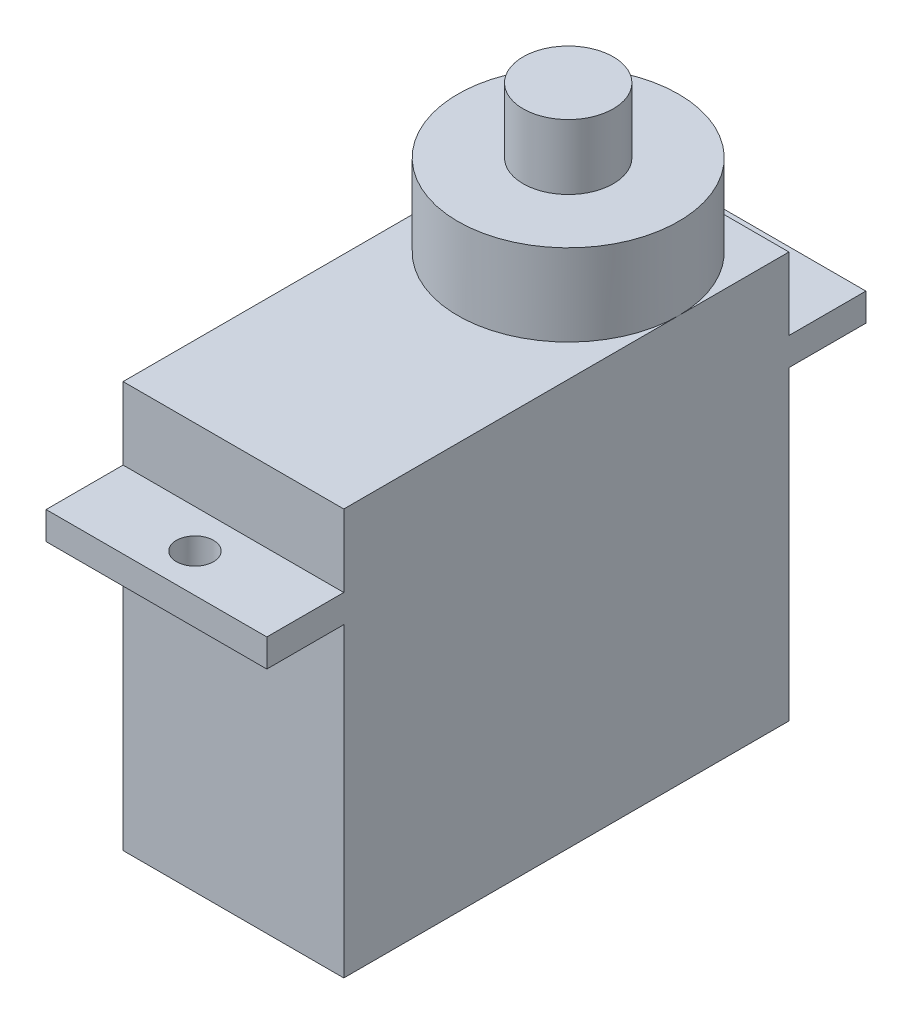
ISO-10303-21;
HEADER;
FILE_DESCRIPTION(('STEP AP214'),'2;1');
FILE_NAME('part.step','',(''),(''),'','','');
FILE_SCHEMA(('AUTOMOTIVE_DESIGN { 1 0 10303 214 1 1 1 1 }'));
ENDSEC;
DATA;
#1=APPLICATION_CONTEXT('core data for automotive mechanical design processes');
#2=APPLICATION_PROTOCOL_DEFINITION('international standard','automotive_design',2000,#1);
#3=PRODUCT_CONTEXT('',#1,'mechanical');
#4=PRODUCT('Part','Part','',(#3));
#5=PRODUCT_RELATED_PRODUCT_CATEGORY('part','',(#4));
#6=PRODUCT_DEFINITION_FORMATION('','',#4);
#7=PRODUCT_DEFINITION_CONTEXT('part definition',#1,'design');
#8=PRODUCT_DEFINITION('design','',#6,#7);
#9=PRODUCT_DEFINITION_SHAPE('','',#8);
#10=(LENGTH_UNIT() NAMED_UNIT(*) SI_UNIT(.MILLI.,.METRE.));
#11=(NAMED_UNIT(*) PLANE_ANGLE_UNIT() SI_UNIT($,.RADIAN.));
#12=(NAMED_UNIT(*) SI_UNIT($,.STERADIAN.) SOLID_ANGLE_UNIT());
#13=UNCERTAINTY_MEASURE_WITH_UNIT(LENGTH_MEASURE(1.E-05),#10,'distance_accuracy_value','');
#14=(GEOMETRIC_REPRESENTATION_CONTEXT(3) GLOBAL_UNCERTAINTY_ASSIGNED_CONTEXT((#13)) GLOBAL_UNIT_ASSIGNED_CONTEXT((#10,
#11,#12)) REPRESENTATION_CONTEXT('',''));
#15=CARTESIAN_POINT('',(0.,0.,0.));
#16=DIRECTION('',(0.,0.,1.));
#17=DIRECTION('',(1.,0.,0.));
#18=AXIS2_PLACEMENT_3D('',#15,#16,#17);
#19=CARTESIAN_POINT('',(-5.95,16.5,-12.));
#20=DIRECTION('',(0.,0.,1.));
#21=DIRECTION('',(1.,0.,0.));
#22=AXIS2_PLACEMENT_3D('',#19,#20,#21);
#23=PLANE('',#22);
#24=DIRECTION('',(0.,1.,0.));
#25=VECTOR('',#24,1.);
#26=CARTESIAN_POINT('',(-2.,3.,-12.));
#27=LINE('',#26,#25);
#28=CARTESIAN_POINT('',(-2.,0.,-12.));
#29=VERTEX_POINT('',#28);
#30=CARTESIAN_POINT('',(-2.,3.,-12.));
#31=VERTEX_POINT('',#30);
#32=EDGE_CURVE('E177',#29,#31,#27,.T.);
#33=ORIENTED_EDGE('',*,*,#32,.F.);
#34=DIRECTION('',(-1.,0.,0.));
#35=VECTOR('',#34,1.);
#36=CARTESIAN_POINT('',(-5.95,0.,-12.));
#37=LINE('',#36,#35);
#38=CARTESIAN_POINT('',(-5.95,0.,-12.));
#39=VERTEX_POINT('',#38);
#40=EDGE_CURVE('E341',#29,#39,#37,.T.);
#41=ORIENTED_EDGE('',*,*,#40,.T.);
#42=DIRECTION('',(0.,-1.,0.));
#43=VECTOR('',#42,1.);
#44=CARTESIAN_POINT('',(-5.95,16.5,-12.));
#45=LINE('',#44,#43);
#46=CARTESIAN_POINT('',(-5.95,16.5,-12.));
#47=VERTEX_POINT('',#46);
#48=EDGE_CURVE('E362',#47,#39,#45,.T.);
#49=ORIENTED_EDGE('',*,*,#48,.F.);
#50=DIRECTION('',(-1.,0.,0.));
#51=VECTOR('',#50,1.);
#52=CARTESIAN_POINT('',(-5.95,16.5,-12.));
#53=LINE('',#52,#51);
#54=CARTESIAN_POINT('',(5.95,16.5,-12.));
#55=VERTEX_POINT('',#54);
#56=EDGE_CURVE('E335',#55,#47,#53,.T.);
#57=ORIENTED_EDGE('',*,*,#56,.F.);
#58=DIRECTION('',(0.,-1.,0.));
#59=VECTOR('',#58,1.);
#60=CARTESIAN_POINT('',(5.95,16.5,-12.));
#61=LINE('',#60,#59);
#62=CARTESIAN_POINT('',(5.95,0.,-12.));
#63=VERTEX_POINT('',#62);
#64=EDGE_CURVE('E364',#55,#63,#61,.T.);
#65=ORIENTED_EDGE('',*,*,#64,.T.);
#66=CARTESIAN_POINT('',(2.,0.,-12.));
#67=VERTEX_POINT('',#66);
#68=EDGE_CURVE('E347',#63,#67,#37,.T.);
#69=ORIENTED_EDGE('',*,*,#68,.T.);
#70=DIRECTION('',(0.,-1.,0.));
#71=VECTOR('',#70,1.);
#72=CARTESIAN_POINT('',(2.,3.,-12.));
#73=LINE('',#72,#71);
#74=CARTESIAN_POINT('',(2.,3.,-12.));
#75=VERTEX_POINT('',#74);
#76=EDGE_CURVE('E195',#75,#67,#73,.T.);
#77=ORIENTED_EDGE('',*,*,#76,.F.);
#78=DIRECTION('',(1.,0.,0.));
#79=VECTOR('',#78,1.);
#80=CARTESIAN_POINT('',(2.,3.,-12.));
#81=LINE('',#80,#79);
#82=EDGE_CURVE('E197',#31,#75,#81,.T.);
#83=ORIENTED_EDGE('',*,*,#82,.F.);
#84=EDGE_LOOP('',(#33,#41,#49,#57,#65,#69,#77,#83));
#85=FACE_BOUND('',#84,.T.);
#86=ADVANCED_FACE('F44',(#85),#23,.F.);
#87=CARTESIAN_POINT('',(0.,21.9,0.));
#88=DIRECTION('',(0.,1.,0.));
#89=DIRECTION('',(0.,0.,1.));
#90=AXIS2_PLACEMENT_3D('',#87,#88,#89);
#91=PLANE('',#90);
#92=CARTESIAN_POINT('',(0.,21.9,-6.05));
#93=DIRECTION('',(0.,1.,0.));
#94=DIRECTION('',(0.,0.,1.));
#95=AXIS2_PLACEMENT_3D('',#92,#93,#94);
#96=CIRCLE('',#95,5.95);
#97=CARTESIAN_POINT('',(5.95,21.9,-6.05));
#98=VERTEX_POINT('',#97);
#99=CARTESIAN_POINT('',(0.,21.9,-12.));
#100=VERTEX_POINT('',#99);
#101=EDGE_CURVE('E234',#98,#100,#96,.T.);
#102=ORIENTED_EDGE('',*,*,#101,.F.);
#103=DIRECTION('',(0.,0.,1.));
#104=VECTOR('',#103,1.);
#105=CARTESIAN_POINT('',(5.95,21.9,-12.));
#106=LINE('',#105,#104);
#107=CARTESIAN_POINT('',(5.95,21.9,-12.));
#108=VERTEX_POINT('',#107);
#109=EDGE_CURVE('E252',#108,#98,#106,.T.);
#110=ORIENTED_EDGE('',*,*,#109,.F.);
#111=DIRECTION('',(1.,0.,0.));
#112=VECTOR('',#111,1.);
#113=CARTESIAN_POINT('',(-5.95,21.9,-12.));
#114=LINE('',#113,#112);
#115=EDGE_CURVE('E254',#100,#108,#114,.T.);
#116=ORIENTED_EDGE('',*,*,#115,.F.);
#117=EDGE_LOOP('',(#102,#110,#116));
#118=FACE_BOUND('',#117,.T.);
#119=ADVANCED_FACE('F378',(#118),#91,.T.);
#120=CARTESIAN_POINT('',(-5.95,21.9,-6.05));
#121=VERTEX_POINT('',#120);
#122=EDGE_CURVE('E54',#100,#121,#96,.T.);
#123=ORIENTED_EDGE('',*,*,#122,.F.);
#124=CARTESIAN_POINT('',(-5.95,21.9,-12.));
#125=VERTEX_POINT('',#124);
#126=EDGE_CURVE('E258',#125,#100,#114,.T.);
#127=ORIENTED_EDGE('',*,*,#126,.F.);
#128=DIRECTION('',(0.,0.,1.));
#129=VECTOR('',#128,1.);
#130=CARTESIAN_POINT('',(-5.95,21.9,-12.));
#131=LINE('',#130,#129);
#132=EDGE_CURVE('E245',#125,#121,#131,.T.);
#133=ORIENTED_EDGE('',*,*,#132,.T.);
#134=EDGE_LOOP('',(#123,#127,#133));
#135=FACE_BOUND('',#134,.T.);
#136=ADVANCED_FACE('F384',(#135),#91,.T.);
#137=CARTESIAN_POINT('',(0.,18.,0.));
#138=DIRECTION('',(0.,-1.,0.));
#139=DIRECTION('',(0.,0.,-1.));
#140=AXIS2_PLACEMENT_3D('',#137,#138,#139);
#141=PLANE('',#140);
#142=CARTESIAN_POINT('',(0.,18.,14.075));
#143=DIRECTION('',(0.,1.,0.));
#144=DIRECTION('',(0.,0.,1.));
#145=AXIS2_PLACEMENT_3D('',#142,#143,#144);
#146=CIRCLE('',#145,1.);
#147=CARTESIAN_POINT('',(0.,18.,15.075));
#148=VERTEX_POINT('',#147);
#149=EDGE_CURVE('E217',#148,#148,#146,.T.);
#150=ORIENTED_EDGE('',*,*,#149,.F.);
#151=EDGE_LOOP('',(#150));
#152=FACE_BOUND('',#151,.T.);
#153=DIRECTION('',(1.,0.,0.));
#154=VECTOR('',#153,1.);
#155=CARTESIAN_POINT('',(-5.95,18.,12.));
#156=LINE('',#155,#154);
#157=CARTESIAN_POINT('',(-5.95,18.,12.));
#158=VERTEX_POINT('',#157);
#159=CARTESIAN_POINT('',(5.95,18.,12.));
#160=VERTEX_POINT('',#159);
#161=EDGE_CURVE('E236',#158,#160,#156,.T.);
#162=ORIENTED_EDGE('',*,*,#161,.F.);
#163=DIRECTION('',(0.,0.,1.));
#164=VECTOR('',#163,1.);
#165=CARTESIAN_POINT('',(-5.95,18.,-16.15));
#166=LINE('',#165,#164);
#167=CARTESIAN_POINT('',(-5.95,18.,16.15));
#168=VERTEX_POINT('',#167);
#169=EDGE_CURVE('E296',#158,#168,#166,.T.);
#170=ORIENTED_EDGE('',*,*,#169,.T.);
#171=DIRECTION('',(1.,0.,0.));
#172=VECTOR('',#171,1.);
#173=CARTESIAN_POINT('',(-5.95,18.,16.15));
#174=LINE('',#173,#172);
#175=CARTESIAN_POINT('',(5.95,18.,16.15));
#176=VERTEX_POINT('',#175);
#177=EDGE_CURVE('E291',#168,#176,#174,.T.);
#178=ORIENTED_EDGE('',*,*,#177,.T.);
#179=DIRECTION('',(0.,0.,1.));
#180=VECTOR('',#179,1.);
#181=CARTESIAN_POINT('',(5.95,18.,-16.15));
#182=LINE('',#181,#180);
#183=EDGE_CURVE('E289',#160,#176,#182,.T.);
#184=ORIENTED_EDGE('',*,*,#183,.F.);
#185=EDGE_LOOP('',(#162,#170,#178,#184));
#186=FACE_BOUND('',#185,.T.);
#187=ADVANCED_FACE('F421',(#152,#186),#141,.F.);
#188=CARTESIAN_POINT('',(5.95,16.5,-12.));
#189=DIRECTION('',(-1.,0.,0.));
#190=DIRECTION('',(0.,0.,1.));
#191=AXIS2_PLACEMENT_3D('',#188,#189,#190);
#192=PLANE('',#191);
#193=DIRECTION('',(0.,0.,-1.));
#194=VECTOR('',#193,1.);
#195=CARTESIAN_POINT('',(5.95,0.,-12.));
#196=LINE('',#195,#194);
#197=CARTESIAN_POINT('',(5.95,0.,12.));
#198=VERTEX_POINT('',#197);
#199=EDGE_CURVE('E321',#198,#63,#196,.T.);
#200=ORIENTED_EDGE('',*,*,#199,.T.);
#201=ORIENTED_EDGE('',*,*,#64,.F.);
#202=DIRECTION('',(0.,0.,1.));
#203=VECTOR('',#202,1.);
#204=CARTESIAN_POINT('',(5.95,16.5,-16.15));
#205=LINE('',#204,#203);
#206=CARTESIAN_POINT('',(5.95,16.5,-16.15));
#207=VERTEX_POINT('',#206);
#208=EDGE_CURVE('E308',#207,#55,#205,.T.);
#209=ORIENTED_EDGE('',*,*,#208,.F.);
#210=DIRECTION('',(0.,-1.,0.));
#211=VECTOR('',#210,1.);
#212=CARTESIAN_POINT('',(5.95,18.,-16.15));
#213=LINE('',#212,#211);
#214=CARTESIAN_POINT('',(5.95,18.,-16.15));
#215=VERTEX_POINT('',#214);
#216=EDGE_CURVE('E303',#215,#207,#213,.T.);
#217=ORIENTED_EDGE('',*,*,#216,.F.);
#218=CARTESIAN_POINT('',(5.95,18.,-12.));
#219=VERTEX_POINT('',#218);
#220=EDGE_CURVE('E290',#215,#219,#182,.T.);
#221=ORIENTED_EDGE('',*,*,#220,.T.);
#222=DIRECTION('',(0.,-1.,0.));
#223=VECTOR('',#222,1.);
#224=CARTESIAN_POINT('',(5.95,21.9,-12.));
#225=LINE('',#224,#223);
#226=EDGE_CURVE('E269',#108,#219,#225,.T.);
#227=ORIENTED_EDGE('',*,*,#226,.F.);
#228=ORIENTED_EDGE('',*,*,#109,.T.);
#229=CARTESIAN_POINT('',(5.95,21.9,12.));
#230=VERTEX_POINT('',#229);
#231=EDGE_CURVE('E253',#98,#230,#106,.T.);
#232=ORIENTED_EDGE('',*,*,#231,.T.);
#233=DIRECTION('',(0.,-1.,0.));
#234=VECTOR('',#233,1.);
#235=CARTESIAN_POINT('',(5.95,21.9,12.));
#236=LINE('',#235,#234);
#237=EDGE_CURVE('E273',#230,#160,#236,.T.);
#238=ORIENTED_EDGE('',*,*,#237,.T.);
#239=ORIENTED_EDGE('',*,*,#183,.T.);
#240=DIRECTION('',(0.,-1.,0.));
#241=VECTOR('',#240,1.);
#242=CARTESIAN_POINT('',(5.95,18.,16.15));
#243=LINE('',#242,#241);
#244=CARTESIAN_POINT('',(5.95,16.5,16.15));
#245=VERTEX_POINT('',#244);
#246=EDGE_CURVE('E326',#176,#245,#243,.T.);
#247=ORIENTED_EDGE('',*,*,#246,.T.);
#248=CARTESIAN_POINT('',(5.95,16.5,12.));
#249=VERTEX_POINT('',#248);
#250=EDGE_CURVE('E301',#249,#245,#205,.T.);
#251=ORIENTED_EDGE('',*,*,#250,.F.);
#252=DIRECTION('',(0.,-1.,0.));
#253=VECTOR('',#252,1.);
#254=CARTESIAN_POINT('',(5.95,16.5,12.));
#255=LINE('',#254,#253);
#256=EDGE_CURVE('E343',#249,#198,#255,.T.);
#257=ORIENTED_EDGE('',*,*,#256,.T.);
#258=EDGE_LOOP('',(#200,#201,#209,#217,#221,#227,#228,#232,#238,#239,#247,#251,#257));
#259=FACE_BOUND('',#258,.T.);
#260=ADVANCED_FACE('F50',(#259),#192,.F.);
#261=CARTESIAN_POINT('',(-5.95,16.5,-12.));
#262=DIRECTION('',(1.,0.,0.));
#263=DIRECTION('',(0.,0.,-1.));
#264=AXIS2_PLACEMENT_3D('',#261,#262,#263);
#265=PLANE('',#264);
#266=DIRECTION('',(0.,0.,1.));
#267=VECTOR('',#266,1.);
#268=CARTESIAN_POINT('',(-5.95,0.,-12.));
#269=LINE('',#268,#267);
#270=CARTESIAN_POINT('',(-5.95,0.,12.));
#271=VERTEX_POINT('',#270);
#272=EDGE_CURVE('E348',#39,#271,#269,.T.);
#273=ORIENTED_EDGE('',*,*,#272,.T.);
#274=DIRECTION('',(0.,-1.,0.));
#275=VECTOR('',#274,1.);
#276=CARTESIAN_POINT('',(-5.95,16.5,12.));
#277=LINE('',#276,#275);
#278=CARTESIAN_POINT('',(-5.95,16.5,12.));
#279=VERTEX_POINT('',#278);
#280=EDGE_CURVE('E357',#279,#271,#277,.T.);
#281=ORIENTED_EDGE('',*,*,#280,.F.);
#282=DIRECTION('',(0.,0.,1.));
#283=VECTOR('',#282,1.);
#284=CARTESIAN_POINT('',(-5.95,16.5,-16.15));
#285=LINE('',#284,#283);
#286=CARTESIAN_POINT('',(-5.95,16.5,16.15));
#287=VERTEX_POINT('',#286);
#288=EDGE_CURVE('E314',#279,#287,#285,.T.);
#289=ORIENTED_EDGE('',*,*,#288,.T.);
#290=DIRECTION('',(0.,-1.,0.));
#291=VECTOR('',#290,1.);
#292=CARTESIAN_POINT('',(-5.95,18.,16.15));
#293=LINE('',#292,#291);
#294=EDGE_CURVE('E325',#168,#287,#293,.T.);
#295=ORIENTED_EDGE('',*,*,#294,.F.);
#296=ORIENTED_EDGE('',*,*,#169,.F.);
#297=DIRECTION('',(0.,-1.,0.));
#298=VECTOR('',#297,1.);
#299=CARTESIAN_POINT('',(-5.95,21.9,12.));
#300=LINE('',#299,#298);
#301=CARTESIAN_POINT('',(-5.95,21.9,12.));
#302=VERTEX_POINT('',#301);
#303=EDGE_CURVE('E279',#302,#158,#300,.T.);
#304=ORIENTED_EDGE('',*,*,#303,.F.);
#305=EDGE_CURVE('E249',#121,#302,#131,.T.);
#306=ORIENTED_EDGE('',*,*,#305,.F.);
#307=ORIENTED_EDGE('',*,*,#132,.F.);
#308=DIRECTION('',(0.,-1.,0.));
#309=VECTOR('',#308,1.);
#310=CARTESIAN_POINT('',(-5.95,21.9,-12.));
#311=LINE('',#310,#309);
#312=CARTESIAN_POINT('',(-5.95,18.,-12.));
#313=VERTEX_POINT('',#312);
#314=EDGE_CURVE('E257',#125,#313,#311,.T.);
#315=ORIENTED_EDGE('',*,*,#314,.T.);
#316=CARTESIAN_POINT('',(-5.95,18.,-16.15));
#317=VERTEX_POINT('',#316);
#318=EDGE_CURVE('E300',#317,#313,#166,.T.);
#319=ORIENTED_EDGE('',*,*,#318,.F.);
#320=DIRECTION('',(0.,-1.,0.));
#321=VECTOR('',#320,1.);
#322=CARTESIAN_POINT('',(-5.95,18.,-16.15));
#323=LINE('',#322,#321);
#324=CARTESIAN_POINT('',(-5.95,16.5,-16.15));
#325=VERTEX_POINT('',#324);
#326=EDGE_CURVE('E318',#317,#325,#323,.T.);
#327=ORIENTED_EDGE('',*,*,#326,.T.);
#328=EDGE_CURVE('E287',#325,#47,#285,.T.);
#329=ORIENTED_EDGE('',*,*,#328,.T.);
#330=ORIENTED_EDGE('',*,*,#48,.T.);
#331=EDGE_LOOP('',(#273,#281,#289,#295,#296,#304,#306,#307,#315,#319,#327,#329,#330));
#332=FACE_BOUND('',#331,.T.);
#333=ADVANCED_FACE('F389',(#332),#265,.F.);
#334=CARTESIAN_POINT('',(-5.95,16.5,12.));
#335=DIRECTION('',(0.,0.,-1.));
#336=DIRECTION('',(-1.,0.,0.));
#337=AXIS2_PLACEMENT_3D('',#334,#335,#336);
#338=PLANE('',#337);
#339=DIRECTION('',(1.,0.,0.));
#340=VECTOR('',#339,1.);
#341=CARTESIAN_POINT('',(-5.95,0.,12.));
#342=LINE('',#341,#340);
#343=EDGE_CURVE('E336',#271,#198,#342,.T.);
#344=ORIENTED_EDGE('',*,*,#343,.T.);
#345=ORIENTED_EDGE('',*,*,#256,.F.);
#346=DIRECTION('',(1.,0.,0.));
#347=VECTOR('',#346,1.);
#348=CARTESIAN_POINT('',(-5.95,16.5,12.));
#349=LINE('',#348,#347);
#350=EDGE_CURVE('E339',#279,#249,#349,.T.);
#351=ORIENTED_EDGE('',*,*,#350,.F.);
#352=ORIENTED_EDGE('',*,*,#280,.T.);
#353=EDGE_LOOP('',(#344,#345,#351,#352));
#354=FACE_BOUND('',#353,.T.);
#355=ADVANCED_FACE('F454',(#354),#338,.F.);
#356=CARTESIAN_POINT('',(0.,0.,0.));
#357=DIRECTION('',(0.,1.,0.));
#358=DIRECTION('',(0.,0.,1.));
#359=AXIS2_PLACEMENT_3D('',#356,#357,#358);
#360=PLANE('',#359);
#361=DIRECTION('',(-1.,0.,0.));
#362=VECTOR('',#361,1.);
#363=CARTESIAN_POINT('',(2.,0.,-8.5));
#364=LINE('',#363,#362);
#365=CARTESIAN_POINT('',(2.,0.,-8.5));
#366=VERTEX_POINT('',#365);
#367=CARTESIAN_POINT('',(-2.,0.,-8.5));
#368=VERTEX_POINT('',#367);
#369=EDGE_CURVE('E184',#366,#368,#364,.T.);
#370=ORIENTED_EDGE('',*,*,#369,.F.);
#371=DIRECTION('',(0.,0.,-1.));
#372=VECTOR('',#371,1.);
#373=CARTESIAN_POINT('',(2.,0.,-8.5));
#374=LINE('',#373,#372);
#375=EDGE_CURVE('E215',#366,#67,#374,.T.);
#376=ORIENTED_EDGE('',*,*,#375,.T.);
#377=ORIENTED_EDGE('',*,*,#68,.F.);
#378=ORIENTED_EDGE('',*,*,#199,.F.);
#379=ORIENTED_EDGE('',*,*,#343,.F.);
#380=ORIENTED_EDGE('',*,*,#272,.F.);
#381=ORIENTED_EDGE('',*,*,#40,.F.);
#382=DIRECTION('',(0.,0.,-1.));
#383=VECTOR('',#382,1.);
#384=CARTESIAN_POINT('',(-2.,0.,-8.5));
#385=LINE('',#384,#383);
#386=EDGE_CURVE('E208',#368,#29,#385,.T.);
#387=ORIENTED_EDGE('',*,*,#386,.F.);
#388=EDGE_LOOP('',(#370,#376,#377,#378,#379,#380,#381,#387));
#389=FACE_BOUND('',#388,.T.);
#390=ADVANCED_FACE('F451',(#389),#360,.F.);
#391=CARTESIAN_POINT('',(0.,16.5,0.));
#392=DIRECTION('',(0.,-1.,0.));
#393=DIRECTION('',(0.,0.,-1.));
#394=AXIS2_PLACEMENT_3D('',#391,#392,#393);
#395=PLANE('',#394);
#396=CARTESIAN_POINT('',(0.,16.5,-14.075));
#397=DIRECTION('',(0.,-1.,0.));
#398=DIRECTION('',(0.,0.,-1.));
#399=AXIS2_PLACEMENT_3D('',#396,#397,#398);
#400=CIRCLE('',#399,1.);
#401=CARTESIAN_POINT('',(0.,16.5,-15.075));
#402=VERTEX_POINT('',#401);
#403=EDGE_CURVE('E223',#402,#402,#400,.T.);
#404=ORIENTED_EDGE('',*,*,#403,.F.);
#405=EDGE_LOOP('',(#404));
#406=FACE_BOUND('',#405,.T.);
#407=ORIENTED_EDGE('',*,*,#208,.T.);
#408=ORIENTED_EDGE('',*,*,#56,.T.);
#409=ORIENTED_EDGE('',*,*,#328,.F.);
#410=DIRECTION('',(1.,0.,0.));
#411=VECTOR('',#410,1.);
#412=CARTESIAN_POINT('',(-5.95,16.5,-16.15));
#413=LINE('',#412,#411);
#414=EDGE_CURVE('E281',#325,#207,#413,.T.);
#415=ORIENTED_EDGE('',*,*,#414,.T.);
#416=EDGE_LOOP('',(#407,#408,#409,#415));
#417=FACE_BOUND('',#416,.T.);
#418=ADVANCED_FACE('F410',(#406,#417),#395,.T.);
#419=CARTESIAN_POINT('',(-5.95,18.,-16.15));
#420=DIRECTION('',(0.,0.,-1.));
#421=DIRECTION('',(-1.,0.,0.));
#422=AXIS2_PLACEMENT_3D('',#419,#420,#421);
#423=PLANE('',#422);
#424=ORIENTED_EDGE('',*,*,#414,.F.);
#425=ORIENTED_EDGE('',*,*,#326,.F.);
#426=DIRECTION('',(1.,0.,0.));
#427=VECTOR('',#426,1.);
#428=CARTESIAN_POINT('',(-5.95,18.,-16.15));
#429=LINE('',#428,#427);
#430=EDGE_CURVE('E285',#317,#215,#429,.T.);
#431=ORIENTED_EDGE('',*,*,#430,.T.);
#432=ORIENTED_EDGE('',*,*,#216,.T.);
#433=EDGE_LOOP('',(#424,#425,#431,#432));
#434=FACE_BOUND('',#433,.T.);
#435=ADVANCED_FACE('F431',(#434),#423,.T.);
#436=CARTESIAN_POINT('',(-5.95,18.,16.15));
#437=DIRECTION('',(0.,0.,-1.));
#438=DIRECTION('',(-1.,0.,0.));
#439=AXIS2_PLACEMENT_3D('',#436,#437,#438);
#440=PLANE('',#439);
#441=DIRECTION('',(1.,0.,0.));
#442=VECTOR('',#441,1.);
#443=CARTESIAN_POINT('',(-5.95,16.5,16.15));
#444=LINE('',#443,#442);
#445=EDGE_CURVE('E309',#287,#245,#444,.T.);
#446=ORIENTED_EDGE('',*,*,#445,.T.);
#447=ORIENTED_EDGE('',*,*,#246,.F.);
#448=ORIENTED_EDGE('',*,*,#177,.F.);
#449=ORIENTED_EDGE('',*,*,#294,.T.);
#450=EDGE_LOOP('',(#446,#447,#448,#449));
#451=FACE_BOUND('',#450,.T.);
#452=ADVANCED_FACE('F427',(#451),#440,.F.);
#453=CARTESIAN_POINT('',(0.,18.,-14.075));
#454=DIRECTION('',(0.,1.,0.));
#455=DIRECTION('',(0.,0.,1.));
#456=AXIS2_PLACEMENT_3D('',#453,#454,#455);
#457=CIRCLE('',#456,1.);
#458=CARTESIAN_POINT('',(0.,18.,-13.075));
#459=VERTEX_POINT('',#458);
#460=EDGE_CURVE('E211',#459,#459,#457,.T.);
#461=ORIENTED_EDGE('',*,*,#460,.F.);
#462=EDGE_LOOP('',(#461));
#463=FACE_BOUND('',#462,.T.);
#464=ORIENTED_EDGE('',*,*,#318,.T.);
#465=DIRECTION('',(1.,0.,0.));
#466=VECTOR('',#465,1.);
#467=CARTESIAN_POINT('',(-5.95,18.,-12.));
#468=LINE('',#467,#466);
#469=EDGE_CURVE('E262',#313,#219,#468,.T.);
#470=ORIENTED_EDGE('',*,*,#469,.T.);
#471=ORIENTED_EDGE('',*,*,#220,.F.);
#472=ORIENTED_EDGE('',*,*,#430,.F.);
#473=EDGE_LOOP('',(#464,#470,#471,#472));
#474=FACE_BOUND('',#473,.T.);
#475=ADVANCED_FACE('F409',(#463,#474),#141,.F.);
#476=CARTESIAN_POINT('',(0.,16.5,14.075));
#477=DIRECTION('',(0.,-1.,0.));
#478=DIRECTION('',(0.,0.,-1.));
#479=AXIS2_PLACEMENT_3D('',#476,#477,#478);
#480=CIRCLE('',#479,1.);
#481=CARTESIAN_POINT('',(0.,16.5,13.075));
#482=VERTEX_POINT('',#481);
#483=EDGE_CURVE('E47',#482,#482,#480,.T.);
#484=ORIENTED_EDGE('',*,*,#483,.F.);
#485=EDGE_LOOP('',(#484));
#486=FACE_BOUND('',#485,.T.);
#487=ORIENTED_EDGE('',*,*,#288,.F.);
#488=ORIENTED_EDGE('',*,*,#350,.T.);
#489=ORIENTED_EDGE('',*,*,#250,.T.);
#490=ORIENTED_EDGE('',*,*,#445,.F.);
#491=EDGE_LOOP('',(#487,#488,#489,#490));
#492=FACE_BOUND('',#491,.T.);
#493=ADVANCED_FACE('F405',(#486,#492),#395,.T.);
#494=CARTESIAN_POINT('',(-5.95,21.9,12.));
#495=DIRECTION('',(0.,0.,-1.));
#496=DIRECTION('',(-1.,0.,0.));
#497=AXIS2_PLACEMENT_3D('',#494,#495,#496);
#498=PLANE('',#497);
#499=ORIENTED_EDGE('',*,*,#161,.T.);
#500=ORIENTED_EDGE('',*,*,#237,.F.);
#501=DIRECTION('',(1.,0.,0.));
#502=VECTOR('',#501,1.);
#503=CARTESIAN_POINT('',(-5.95,21.9,12.));
#504=LINE('',#503,#502);
#505=EDGE_CURVE('E248',#302,#230,#504,.T.);
#506=ORIENTED_EDGE('',*,*,#505,.F.);
#507=ORIENTED_EDGE('',*,*,#303,.T.);
#508=EDGE_LOOP('',(#499,#500,#506,#507));
#509=FACE_BOUND('',#508,.T.);
#510=ADVANCED_FACE('F403',(#509),#498,.F.);
#511=CARTESIAN_POINT('',(-5.95,21.9,-12.));
#512=DIRECTION('',(0.,0.,-1.));
#513=DIRECTION('',(-1.,0.,0.));
#514=AXIS2_PLACEMENT_3D('',#511,#512,#513);
#515=PLANE('',#514);
#516=ORIENTED_EDGE('',*,*,#469,.F.);
#517=ORIENTED_EDGE('',*,*,#314,.F.);
#518=ORIENTED_EDGE('',*,*,#126,.T.);
#519=ORIENTED_EDGE('',*,*,#115,.T.);
#520=ORIENTED_EDGE('',*,*,#226,.T.);
#521=EDGE_LOOP('',(#516,#517,#518,#519,#520));
#522=FACE_BOUND('',#521,.T.);
#523=ADVANCED_FACE('F382',(#522),#515,.T.);
#524=EDGE_CURVE('E241',#121,#98,#96,.T.);
#525=ORIENTED_EDGE('',*,*,#524,.F.);
#526=ORIENTED_EDGE('',*,*,#305,.T.);
#527=ORIENTED_EDGE('',*,*,#505,.T.);
#528=ORIENTED_EDGE('',*,*,#231,.F.);
#529=EDGE_LOOP('',(#525,#526,#527,#528));
#530=FACE_BOUND('',#529,.T.);
#531=ADVANCED_FACE('F419',(#530),#91,.T.);
#532=CARTESIAN_POINT('',(0.,26.3,-6.05));
#533=DIRECTION('',(0.,-1.,0.));
#534=DIRECTION('',(0.,0.,-1.));
#535=AXIS2_PLACEMENT_3D('',#532,#533,#534);
#536=CYLINDRICAL_SURFACE('',#535,5.95);
#537=CARTESIAN_POINT('',(0.,26.3,-6.05));
#538=DIRECTION('',(0.,1.,0.));
#539=DIRECTION('',(0.,0.,1.));
#540=AXIS2_PLACEMENT_3D('',#537,#538,#539);
#541=CIRCLE('',#540,5.95);
#542=CARTESIAN_POINT('',(0.,26.3,-0.100000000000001));
#543=VERTEX_POINT('',#542);
#544=EDGE_CURVE('E235',#543,#543,#541,.T.);
#545=ORIENTED_EDGE('',*,*,#544,.F.);
#546=EDGE_LOOP('',(#545));
#547=FACE_BOUND('',#546,.T.);
#548=ORIENTED_EDGE('',*,*,#101,.T.);
#549=ORIENTED_EDGE('',*,*,#122,.T.);
#550=ORIENTED_EDGE('',*,*,#524,.T.);
#551=EDGE_LOOP('',(#548,#549,#550));
#552=FACE_BOUND('',#551,.T.);
#553=ADVANCED_FACE('F372',(#547,#552),#536,.T.);
#554=CARTESIAN_POINT('',(0.,26.3,-6.05));
#555=DIRECTION('',(0.,1.,0.));
#556=DIRECTION('',(0.,0.,1.));
#557=AXIS2_PLACEMENT_3D('',#554,#555,#556);
#558=PLANE('',#557);
#559=CARTESIAN_POINT('',(0.,26.3,-6.05));
#560=DIRECTION('',(0.,1.,0.));
#561=DIRECTION('',(0.,0.,1.));
#562=AXIS2_PLACEMENT_3D('',#559,#560,#561);
#563=CIRCLE('',#562,2.43);
#564=CARTESIAN_POINT('',(0.,26.3,-3.62));
#565=VERTEX_POINT('',#564);
#566=EDGE_CURVE('E11',#565,#565,#563,.T.);
#567=ORIENTED_EDGE('',*,*,#566,.F.);
#568=EDGE_LOOP('',(#567));
#569=FACE_BOUND('',#568,.T.);
#570=ORIENTED_EDGE('',*,*,#544,.T.);
#571=EDGE_LOOP('',(#570));
#572=FACE_BOUND('',#571,.T.);
#573=ADVANCED_FACE('F487',(#569,#572),#558,.T.);
#574=CARTESIAN_POINT('',(0.,29.8,-6.05));
#575=DIRECTION('',(0.,-1.,0.));
#576=DIRECTION('',(0.,0.,-1.));
#577=AXIS2_PLACEMENT_3D('',#574,#575,#576);
#578=CYLINDRICAL_SURFACE('',#577,2.43);
#579=CARTESIAN_POINT('',(0.,29.8,-6.05));
#580=DIRECTION('',(0.,1.,0.));
#581=DIRECTION('',(0.,0.,1.));
#582=AXIS2_PLACEMENT_3D('',#579,#580,#581);
#583=CIRCLE('',#582,2.43);
#584=CARTESIAN_POINT('',(0.,29.8,-3.62));
#585=VERTEX_POINT('',#584);
#586=EDGE_CURVE('E228',#585,#585,#583,.T.);
#587=ORIENTED_EDGE('',*,*,#586,.F.);
#588=EDGE_LOOP('',(#587));
#589=FACE_BOUND('',#588,.T.);
#590=ORIENTED_EDGE('',*,*,#566,.T.);
#591=EDGE_LOOP('',(#590));
#592=FACE_BOUND('',#591,.T.);
#593=ADVANCED_FACE('F484',(#589,#592),#578,.T.);
#594=CARTESIAN_POINT('',(0.,29.8,-6.05));
#595=DIRECTION('',(0.,1.,0.));
#596=DIRECTION('',(0.,0.,1.));
#597=AXIS2_PLACEMENT_3D('',#594,#595,#596);
#598=PLANE('',#597);
#599=ORIENTED_EDGE('',*,*,#586,.T.);
#600=EDGE_LOOP('',(#599));
#601=FACE_BOUND('',#600,.T.);
#602=ADVANCED_FACE('F477',(#601),#598,.T.);
#603=CARTESIAN_POINT('',(0.,0.,14.075));
#604=DIRECTION('',(0.,1.,0.));
#605=DIRECTION('',(0.,0.,1.));
#606=AXIS2_PLACEMENT_3D('',#603,#604,#605);
#607=CYLINDRICAL_SURFACE('',#606,1.);
#608=ORIENTED_EDGE('',*,*,#483,.T.);
#609=EDGE_LOOP('',(#608));
#610=FACE_BOUND('',#609,.T.);
#611=ORIENTED_EDGE('',*,*,#149,.T.);
#612=EDGE_LOOP('',(#611));
#613=FACE_BOUND('',#612,.T.);
#614=ADVANCED_FACE('F400',(#610,#613),#607,.F.);
#615=CARTESIAN_POINT('',(0.,0.,-14.075));
#616=DIRECTION('',(0.,1.,0.));
#617=DIRECTION('',(0.,0.,1.));
#618=AXIS2_PLACEMENT_3D('',#615,#616,#617);
#619=CYLINDRICAL_SURFACE('',#618,1.);
#620=ORIENTED_EDGE('',*,*,#403,.T.);
#621=EDGE_LOOP('',(#620));
#622=FACE_BOUND('',#621,.T.);
#623=ORIENTED_EDGE('',*,*,#460,.T.);
#624=EDGE_LOOP('',(#623));
#625=FACE_BOUND('',#624,.T.);
#626=ADVANCED_FACE('F475',(#622,#625),#619,.F.);
#627=CARTESIAN_POINT('',(-2.,3.,-8.5));
#628=DIRECTION('',(-1.,0.,0.));
#629=DIRECTION('',(0.,-1.,0.));
#630=AXIS2_PLACEMENT_3D('',#627,#628,#629);
#631=PLANE('',#630);
#632=ORIENTED_EDGE('',*,*,#32,.T.);
#633=DIRECTION('',(0.,0.,-1.));
#634=VECTOR('',#633,1.);
#635=CARTESIAN_POINT('',(-2.,3.,-8.5));
#636=LINE('',#635,#634);
#637=CARTESIAN_POINT('',(-2.,3.,-8.5));
#638=VERTEX_POINT('',#637);
#639=EDGE_CURVE('E171',#638,#31,#636,.T.);
#640=ORIENTED_EDGE('',*,*,#639,.F.);
#641=DIRECTION('',(0.,1.,0.));
#642=VECTOR('',#641,1.);
#643=CARTESIAN_POINT('',(-2.,3.,-8.5));
#644=LINE('',#643,#642);
#645=EDGE_CURVE('E178',#368,#638,#644,.T.);
#646=ORIENTED_EDGE('',*,*,#645,.F.);
#647=ORIENTED_EDGE('',*,*,#386,.T.);
#648=EDGE_LOOP('',(#632,#640,#646,#647));
#649=FACE_BOUND('',#648,.T.);
#650=ADVANCED_FACE('F173',(#649),#631,.F.);
#651=CARTESIAN_POINT('',(2.,3.,-8.5));
#652=DIRECTION('',(1.,0.,0.));
#653=DIRECTION('',(0.,0.,-1.));
#654=AXIS2_PLACEMENT_3D('',#651,#652,#653);
#655=PLANE('',#654);
#656=ORIENTED_EDGE('',*,*,#76,.T.);
#657=ORIENTED_EDGE('',*,*,#375,.F.);
#658=DIRECTION('',(0.,-1.,0.));
#659=VECTOR('',#658,1.);
#660=CARTESIAN_POINT('',(2.,3.,-8.5));
#661=LINE('',#660,#659);
#662=CARTESIAN_POINT('',(2.,3.,-8.5));
#663=VERTEX_POINT('',#662);
#664=EDGE_CURVE('E65',#663,#366,#661,.T.);
#665=ORIENTED_EDGE('',*,*,#664,.F.);
#666=DIRECTION('',(0.,0.,-1.));
#667=VECTOR('',#666,1.);
#668=CARTESIAN_POINT('',(2.,3.,-8.5));
#669=LINE('',#668,#667);
#670=EDGE_CURVE('E181',#663,#75,#669,.T.);
#671=ORIENTED_EDGE('',*,*,#670,.T.);
#672=EDGE_LOOP('',(#656,#657,#665,#671));
#673=FACE_BOUND('',#672,.T.);
#674=ADVANCED_FACE('F469',(#673),#655,.F.);
#675=CARTESIAN_POINT('',(2.,3.,-8.5));
#676=DIRECTION('',(0.,1.,0.));
#677=DIRECTION('',(-1.,0.,0.));
#678=AXIS2_PLACEMENT_3D('',#675,#676,#677);
#679=PLANE('',#678);
#680=ORIENTED_EDGE('',*,*,#82,.T.);
#681=ORIENTED_EDGE('',*,*,#670,.F.);
#682=DIRECTION('',(1.,0.,0.));
#683=VECTOR('',#682,1.);
#684=CARTESIAN_POINT('',(2.,3.,-8.5));
#685=LINE('',#684,#683);
#686=EDGE_CURVE('E189',#638,#663,#685,.T.);
#687=ORIENTED_EDGE('',*,*,#686,.F.);
#688=ORIENTED_EDGE('',*,*,#639,.T.);
#689=EDGE_LOOP('',(#680,#681,#687,#688));
#690=FACE_BOUND('',#689,.T.);
#691=ADVANCED_FACE('F186',(#690),#679,.F.);
#692=CARTESIAN_POINT('',(0.,0.,-8.5));
#693=DIRECTION('',(0.,0.,-1.));
#694=DIRECTION('',(-1.,0.,0.));
#695=AXIS2_PLACEMENT_3D('',#692,#693,#694);
#696=PLANE('',#695);
#697=ORIENTED_EDGE('',*,*,#645,.T.);
#698=ORIENTED_EDGE('',*,*,#686,.T.);
#699=ORIENTED_EDGE('',*,*,#664,.T.);
#700=ORIENTED_EDGE('',*,*,#369,.T.);
#701=EDGE_LOOP('',(#697,#698,#699,#700));
#702=FACE_BOUND('',#701,.T.);
#703=ADVANCED_FACE('F187',(#702),#696,.T.);
#704=CLOSED_SHELL('',(#86,#119,#136,#187,#260,#333,#355,#390,#418,#435,#452,#475,#493,#510,#523,
#531,#553,#573,#593,#602,#614,#626,#650,#674,#691,#703));
#705=MANIFOLD_SOLID_BREP('B2',#704);
#706=ADVANCED_BREP_SHAPE_REPRESENTATION('',(#18,#705),#14);
#707=SHAPE_DEFINITION_REPRESENTATION(#9,#706);
ENDSEC;
END-ISO-10303-21;
